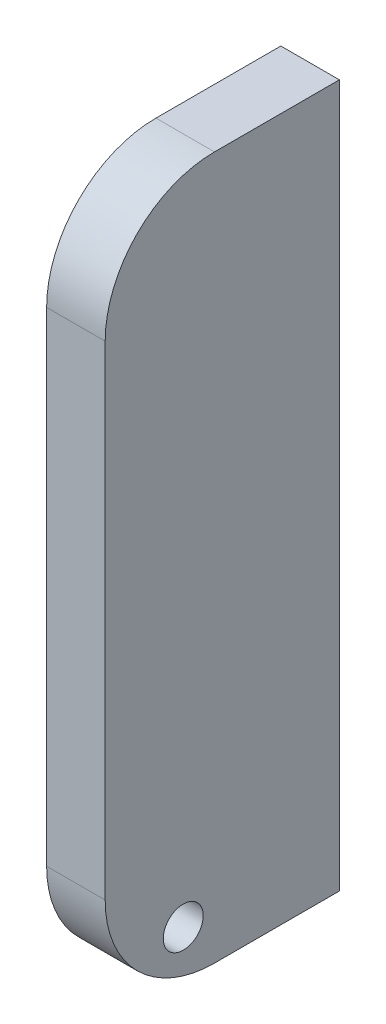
ISO-10303-21;
HEADER;
FILE_DESCRIPTION(('STEP AP214'),'2;1');
FILE_NAME('part.step','',(''),(''),'','','');
FILE_SCHEMA(('AUTOMOTIVE_DESIGN { 1 0 10303 214 1 1 1 1 }'));
ENDSEC;
DATA;
#1=APPLICATION_CONTEXT('core data for automotive mechanical design processes');
#2=APPLICATION_PROTOCOL_DEFINITION('international standard','automotive_design',2000,#1);
#3=PRODUCT_CONTEXT('',#1,'mechanical');
#4=PRODUCT('Part','Part','',(#3));
#5=PRODUCT_RELATED_PRODUCT_CATEGORY('part','',(#4));
#6=PRODUCT_DEFINITION_FORMATION('','',#4);
#7=PRODUCT_DEFINITION_CONTEXT('part definition',#1,'design');
#8=PRODUCT_DEFINITION('design','',#6,#7);
#9=PRODUCT_DEFINITION_SHAPE('','',#8);
#10=(LENGTH_UNIT() NAMED_UNIT(*) SI_UNIT(.MILLI.,.METRE.));
#11=(NAMED_UNIT(*) PLANE_ANGLE_UNIT() SI_UNIT($,.RADIAN.));
#12=(NAMED_UNIT(*) SI_UNIT($,.STERADIAN.) SOLID_ANGLE_UNIT());
#13=UNCERTAINTY_MEASURE_WITH_UNIT(LENGTH_MEASURE(1.E-05),#10,'distance_accuracy_value','');
#14=(GEOMETRIC_REPRESENTATION_CONTEXT(3) GLOBAL_UNCERTAINTY_ASSIGNED_CONTEXT((#13)) GLOBAL_UNIT_ASSIGNED_CONTEXT((#10,
#11,#12)) REPRESENTATION_CONTEXT('',''));
#15=CARTESIAN_POINT('',(0.,0.,0.));
#16=DIRECTION('',(0.,0.,1.));
#17=DIRECTION('',(1.,0.,0.));
#18=AXIS2_PLACEMENT_3D('',#15,#16,#17);
#19=CARTESIAN_POINT('',(-118.25,-19.05,38.1));
#20=DIRECTION('',(1.,0.,0.));
#21=DIRECTION('',(0.,0.,-1.));
#22=AXIS2_PLACEMENT_3D('',#19,#20,#21);
#23=PLANE('',#22);
#24=CARTESIAN_POINT('',(-118.25,-11.43,25.4));
#25=DIRECTION('',(-1.,0.,0.));
#26=DIRECTION('',(0.,0.,1.));
#27=AXIS2_PLACEMENT_3D('',#24,#25,#26);
#28=CIRCLE('',#27,3.25);
#29=CARTESIAN_POINT('',(-118.25,-11.43,28.65));
#30=VERTEX_POINT('',#29);
#31=EDGE_CURVE('E112',#30,#30,#28,.T.);
#32=ORIENTED_EDGE('',*,*,#31,.F.);
#33=EDGE_LOOP('',(#32));
#34=FACE_BOUND('',#33,.T.);
#35=DIRECTION('',(0.,-1.,0.));
#36=VECTOR('',#35,1.);
#37=CARTESIAN_POINT('',(-118.25,-19.05,38.1));
#38=LINE('',#37,#36);
#39=CARTESIAN_POINT('',(-118.25,77.47,38.1));
#40=VERTEX_POINT('',#39);
#41=CARTESIAN_POINT('',(-118.25,-1.26999999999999,38.1));
#42=VERTEX_POINT('',#41);
#43=EDGE_CURVE('E121',#40,#42,#38,.T.);
#44=ORIENTED_EDGE('',*,*,#43,.F.);
#45=CARTESIAN_POINT('',(-118.25,77.47,20.32));
#46=DIRECTION('',(1.,0.,0.));
#47=DIRECTION('',(0.,0.,-1.));
#48=AXIS2_PLACEMENT_3D('',#45,#46,#47);
#49=CIRCLE('',#48,17.78);
#50=CARTESIAN_POINT('',(-118.25,95.25,20.32));
#51=VERTEX_POINT('',#50);
#52=EDGE_CURVE('E133',#40,#51,#49,.F.);
#53=ORIENTED_EDGE('',*,*,#52,.T.);
#54=DIRECTION('',(0.,0.,-1.));
#55=VECTOR('',#54,1.);
#56=CARTESIAN_POINT('',(-118.25,95.25,38.1));
#57=LINE('',#56,#55);
#58=CARTESIAN_POINT('',(-118.25,95.25,0.));
#59=VERTEX_POINT('',#58);
#60=EDGE_CURVE('E107',#51,#59,#57,.T.);
#61=ORIENTED_EDGE('',*,*,#60,.T.);
#62=DIRECTION('',(0.,-1.,0.));
#63=VECTOR('',#62,1.);
#64=CARTESIAN_POINT('',(-118.25,-19.05,0.));
#65=LINE('',#64,#63);
#66=CARTESIAN_POINT('',(-118.25,-19.05,0.));
#67=VERTEX_POINT('',#66);
#68=EDGE_CURVE('E102',#59,#67,#65,.T.);
#69=ORIENTED_EDGE('',*,*,#68,.T.);
#70=DIRECTION('',(0.,0.,-1.));
#71=VECTOR('',#70,1.);
#72=CARTESIAN_POINT('',(-118.25,-19.05,38.1));
#73=LINE('',#72,#71);
#74=CARTESIAN_POINT('',(-118.25,-19.05,20.32));
#75=VERTEX_POINT('',#74);
#76=EDGE_CURVE('E86',#75,#67,#73,.T.);
#77=ORIENTED_EDGE('',*,*,#76,.F.);
#78=CARTESIAN_POINT('',(-118.25,-1.26999999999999,20.32));
#79=DIRECTION('',(1.,0.,0.));
#80=DIRECTION('',(0.,0.,-1.));
#81=AXIS2_PLACEMENT_3D('',#78,#79,#80);
#82=CIRCLE('',#81,17.78);
#83=EDGE_CURVE('E131',#75,#42,#82,.F.);
#84=ORIENTED_EDGE('',*,*,#83,.T.);
#85=EDGE_LOOP('',(#44,#53,#61,#69,#77,#84));
#86=FACE_BOUND('',#85,.T.);
#87=ADVANCED_FACE('F33',(#34,#86),#23,.F.);
#88=CARTESIAN_POINT('',(-118.25,-19.05,38.1));
#89=DIRECTION('',(0.,1.,0.));
#90=DIRECTION('',(0.,0.,1.));
#91=AXIS2_PLACEMENT_3D('',#88,#89,#90);
#92=PLANE('',#91);
#93=DIRECTION('',(0.,0.,-1.));
#94=VECTOR('',#93,1.);
#95=CARTESIAN_POINT('',(-108.725,-19.05,38.1));
#96=LINE('',#95,#94);
#97=CARTESIAN_POINT('',(-108.725,-19.05,20.32));
#98=VERTEX_POINT('',#97);
#99=CARTESIAN_POINT('',(-108.725,-19.05,0.));
#100=VERTEX_POINT('',#99);
#101=EDGE_CURVE('E96',#98,#100,#96,.T.);
#102=ORIENTED_EDGE('',*,*,#101,.F.);
#103=DIRECTION('',(1.,0.,0.));
#104=VECTOR('',#103,1.);
#105=CARTESIAN_POINT('',(-118.25,-19.05,20.32));
#106=LINE('',#105,#104);
#107=EDGE_CURVE('E11',#98,#75,#106,.F.);
#108=ORIENTED_EDGE('',*,*,#107,.T.);
#109=ORIENTED_EDGE('',*,*,#76,.T.);
#110=DIRECTION('',(1.,0.,0.));
#111=VECTOR('',#110,1.);
#112=CARTESIAN_POINT('',(-118.25,-19.05,0.));
#113=LINE('',#112,#111);
#114=EDGE_CURVE('E89',#67,#100,#113,.T.);
#115=ORIENTED_EDGE('',*,*,#114,.T.);
#116=EDGE_LOOP('',(#102,#108,#109,#115));
#117=FACE_BOUND('',#116,.T.);
#118=ADVANCED_FACE('F88',(#117),#92,.F.);
#119=CARTESIAN_POINT('',(-108.725,-19.05,38.1));
#120=DIRECTION('',(-1.,0.,0.));
#121=DIRECTION('',(0.,0.,1.));
#122=AXIS2_PLACEMENT_3D('',#119,#120,#121);
#123=PLANE('',#122);
#124=CARTESIAN_POINT('',(-108.725,-11.43,25.4));
#125=DIRECTION('',(-1.,0.,0.));
#126=DIRECTION('',(0.,0.,1.));
#127=AXIS2_PLACEMENT_3D('',#124,#125,#126);
#128=CIRCLE('',#127,3.25);
#129=CARTESIAN_POINT('',(-108.725,-11.43,28.65));
#130=VERTEX_POINT('',#129);
#131=EDGE_CURVE('E109',#130,#130,#128,.T.);
#132=ORIENTED_EDGE('',*,*,#131,.T.);
#133=EDGE_LOOP('',(#132));
#134=FACE_BOUND('',#133,.T.);
#135=DIRECTION('',(0.,0.,-1.));
#136=VECTOR('',#135,1.);
#137=CARTESIAN_POINT('',(-108.725,95.25,38.1));
#138=LINE('',#137,#136);
#139=CARTESIAN_POINT('',(-108.725,95.25,20.32));
#140=VERTEX_POINT('',#139);
#141=CARTESIAN_POINT('',(-108.725,95.25,0.));
#142=VERTEX_POINT('',#141);
#143=EDGE_CURVE('E123',#140,#142,#138,.T.);
#144=ORIENTED_EDGE('',*,*,#143,.F.);
#145=CARTESIAN_POINT('',(-108.725,77.47,20.32));
#146=DIRECTION('',(-1.,0.,0.));
#147=DIRECTION('',(0.,0.,1.));
#148=AXIS2_PLACEMENT_3D('',#145,#146,#147);
#149=CIRCLE('',#148,17.78);
#150=CARTESIAN_POINT('',(-108.725,77.47,38.1));
#151=VERTEX_POINT('',#150);
#152=EDGE_CURVE('E41',#140,#151,#149,.F.);
#153=ORIENTED_EDGE('',*,*,#152,.T.);
#154=DIRECTION('',(0.,1.,0.));
#155=VECTOR('',#154,1.);
#156=CARTESIAN_POINT('',(-108.725,-19.05,38.1));
#157=LINE('',#156,#155);
#158=CARTESIAN_POINT('',(-108.725,-1.26999999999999,38.1));
#159=VERTEX_POINT('',#158);
#160=EDGE_CURVE('E115',#159,#151,#157,.T.);
#161=ORIENTED_EDGE('',*,*,#160,.F.);
#162=CARTESIAN_POINT('',(-108.725,-1.26999999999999,20.32));
#163=DIRECTION('',(-1.,0.,0.));
#164=DIRECTION('',(0.,0.,1.));
#165=AXIS2_PLACEMENT_3D('',#162,#163,#164);
#166=CIRCLE('',#165,17.78);
#167=EDGE_CURVE('E48',#159,#98,#166,.F.);
#168=ORIENTED_EDGE('',*,*,#167,.T.);
#169=ORIENTED_EDGE('',*,*,#101,.T.);
#170=DIRECTION('',(0.,1.,0.));
#171=VECTOR('',#170,1.);
#172=CARTESIAN_POINT('',(-108.725,-19.05,0.));
#173=LINE('',#172,#171);
#174=EDGE_CURVE('E104',#100,#142,#173,.T.);
#175=ORIENTED_EDGE('',*,*,#174,.T.);
#176=EDGE_LOOP('',(#144,#153,#161,#168,#169,#175));
#177=FACE_BOUND('',#176,.T.);
#178=ADVANCED_FACE('F138',(#134,#177),#123,.F.);
#179=CARTESIAN_POINT('',(-118.25,95.25,38.1));
#180=DIRECTION('',(0.,-1.,0.));
#181=DIRECTION('',(0.,0.,-1.));
#182=AXIS2_PLACEMENT_3D('',#179,#180,#181);
#183=PLANE('',#182);
#184=ORIENTED_EDGE('',*,*,#60,.F.);
#185=DIRECTION('',(-1.,0.,0.));
#186=VECTOR('',#185,1.);
#187=CARTESIAN_POINT('',(-118.25,95.25,20.32));
#188=LINE('',#187,#186);
#189=EDGE_CURVE('E56',#51,#140,#188,.F.);
#190=ORIENTED_EDGE('',*,*,#189,.T.);
#191=ORIENTED_EDGE('',*,*,#143,.T.);
#192=DIRECTION('',(-1.,0.,0.));
#193=VECTOR('',#192,1.);
#194=CARTESIAN_POINT('',(-118.25,95.25,0.));
#195=LINE('',#194,#193);
#196=EDGE_CURVE('E119',#142,#59,#195,.T.);
#197=ORIENTED_EDGE('',*,*,#196,.T.);
#198=EDGE_LOOP('',(#184,#190,#191,#197));
#199=FACE_BOUND('',#198,.T.);
#200=ADVANCED_FACE('F146',(#199),#183,.F.);
#201=CARTESIAN_POINT('',(0.,0.,38.1));
#202=DIRECTION('',(0.,0.,-1.));
#203=DIRECTION('',(-1.,0.,0.));
#204=AXIS2_PLACEMENT_3D('',#201,#202,#203);
#205=PLANE('',#204);
#206=ORIENTED_EDGE('',*,*,#160,.T.);
#207=DIRECTION('',(-1.,0.,0.));
#208=VECTOR('',#207,1.);
#209=CARTESIAN_POINT('',(0.,77.47,38.1));
#210=LINE('',#209,#208);
#211=EDGE_CURVE('E128',#151,#40,#210,.T.);
#212=ORIENTED_EDGE('',*,*,#211,.T.);
#213=ORIENTED_EDGE('',*,*,#43,.T.);
#214=DIRECTION('',(1.,0.,0.));
#215=VECTOR('',#214,1.);
#216=CARTESIAN_POINT('',(0.,-1.26999999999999,38.1));
#217=LINE('',#216,#215);
#218=EDGE_CURVE('E95',#42,#159,#217,.T.);
#219=ORIENTED_EDGE('',*,*,#218,.T.);
#220=EDGE_LOOP('',(#206,#212,#213,#219));
#221=FACE_BOUND('',#220,.T.);
#222=ADVANCED_FACE('F142',(#221),#205,.F.);
#223=CARTESIAN_POINT('',(0.,0.,0.));
#224=DIRECTION('',(0.,0.,-1.));
#225=DIRECTION('',(-1.,0.,0.));
#226=AXIS2_PLACEMENT_3D('',#223,#224,#225);
#227=PLANE('',#226);
#228=ORIENTED_EDGE('',*,*,#68,.F.);
#229=ORIENTED_EDGE('',*,*,#196,.F.);
#230=ORIENTED_EDGE('',*,*,#174,.F.);
#231=ORIENTED_EDGE('',*,*,#114,.F.);
#232=EDGE_LOOP('',(#228,#229,#230,#231));
#233=FACE_BOUND('',#232,.T.);
#234=ADVANCED_FACE('F100',(#233),#227,.T.);
#235=CARTESIAN_POINT('',(0.,77.47,20.32));
#236=DIRECTION('',(-1.,0.,0.));
#237=DIRECTION('',(0.,0.,1.));
#238=AXIS2_PLACEMENT_3D('',#235,#236,#237);
#239=CYLINDRICAL_SURFACE('',#238,17.78);
#240=ORIENTED_EDGE('',*,*,#152,.F.);
#241=ORIENTED_EDGE('',*,*,#189,.F.);
#242=ORIENTED_EDGE('',*,*,#52,.F.);
#243=ORIENTED_EDGE('',*,*,#211,.F.);
#244=EDGE_LOOP('',(#240,#241,#242,#243));
#245=FACE_BOUND('',#244,.T.);
#246=ADVANCED_FACE('F145',(#245),#239,.T.);
#247=CARTESIAN_POINT('',(0.,-1.26999999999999,20.32));
#248=DIRECTION('',(1.,0.,0.));
#249=DIRECTION('',(0.,0.,-1.));
#250=AXIS2_PLACEMENT_3D('',#247,#248,#249);
#251=CYLINDRICAL_SURFACE('',#250,17.78);
#252=ORIENTED_EDGE('',*,*,#83,.F.);
#253=ORIENTED_EDGE('',*,*,#107,.F.);
#254=ORIENTED_EDGE('',*,*,#167,.F.);
#255=ORIENTED_EDGE('',*,*,#218,.F.);
#256=EDGE_LOOP('',(#252,#253,#254,#255));
#257=FACE_BOUND('',#256,.T.);
#258=ADVANCED_FACE('F35',(#257),#251,.T.);
#259=CARTESIAN_POINT('',(-108.725,-11.43,25.4));
#260=DIRECTION('',(-1.,0.,0.));
#261=DIRECTION('',(0.,0.,1.));
#262=AXIS2_PLACEMENT_3D('',#259,#260,#261);
#263=CYLINDRICAL_SURFACE('',#262,3.25);
#264=ORIENTED_EDGE('',*,*,#131,.F.);
#265=EDGE_LOOP('',(#264));
#266=FACE_BOUND('',#265,.T.);
#267=ORIENTED_EDGE('',*,*,#31,.T.);
#268=EDGE_LOOP('',(#267));
#269=FACE_BOUND('',#268,.T.);
#270=ADVANCED_FACE('F152',(#266,#269),#263,.F.);
#271=CLOSED_SHELL('',(#87,#118,#178,#200,#222,#234,#246,#258,#270));
#272=MANIFOLD_SOLID_BREP('B2',#271);
#273=ADVANCED_BREP_SHAPE_REPRESENTATION('',(#18,#272),#14);
#274=SHAPE_DEFINITION_REPRESENTATION(#9,#273);
ENDSEC;
END-ISO-10303-21;
